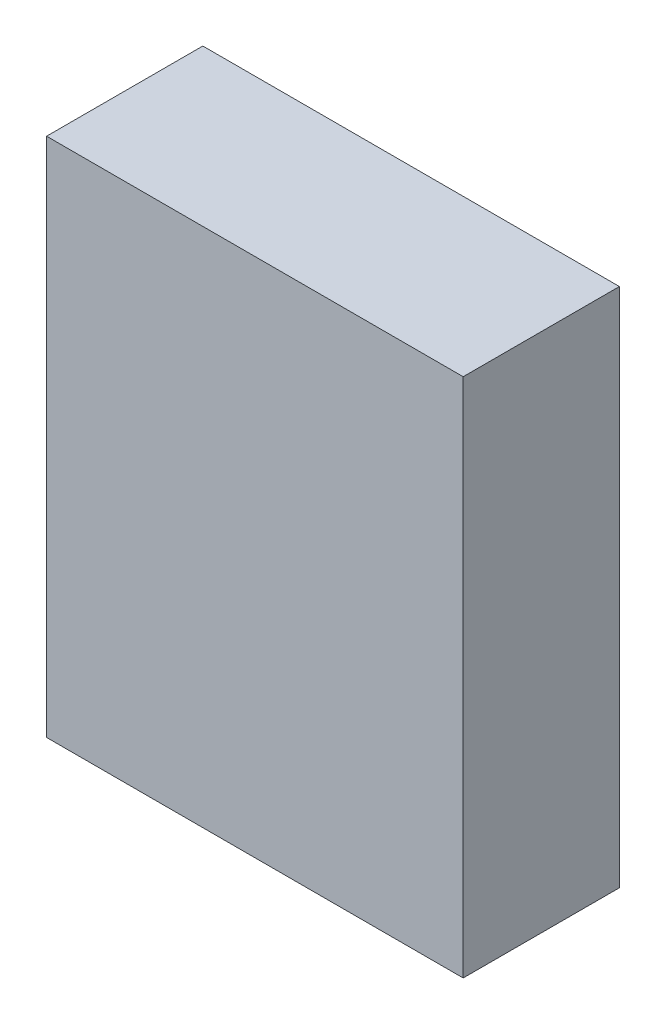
ISO-10303-21;
HEADER;
FILE_DESCRIPTION(('STEP AP214'),'2;1');
FILE_NAME('part.step','',(''),(''),'','','');
FILE_SCHEMA(('AUTOMOTIVE_DESIGN { 1 0 10303 214 1 1 1 1 }'));
ENDSEC;
DATA;
#1=APPLICATION_CONTEXT('core data for automotive mechanical design processes');
#2=APPLICATION_PROTOCOL_DEFINITION('international standard','automotive_design',2000,#1);
#3=PRODUCT_CONTEXT('',#1,'mechanical');
#4=PRODUCT('Part','Part','',(#3));
#5=PRODUCT_RELATED_PRODUCT_CATEGORY('part','',(#4));
#6=PRODUCT_DEFINITION_FORMATION('','',#4);
#7=PRODUCT_DEFINITION_CONTEXT('part definition',#1,'design');
#8=PRODUCT_DEFINITION('design','',#6,#7);
#9=PRODUCT_DEFINITION_SHAPE('','',#8);
#10=(LENGTH_UNIT() NAMED_UNIT(*) SI_UNIT(.MILLI.,.METRE.));
#11=(NAMED_UNIT(*) PLANE_ANGLE_UNIT() SI_UNIT($,.RADIAN.));
#12=(NAMED_UNIT(*) SI_UNIT($,.STERADIAN.) SOLID_ANGLE_UNIT());
#13=UNCERTAINTY_MEASURE_WITH_UNIT(LENGTH_MEASURE(1.E-05),#10,'distance_accuracy_value','');
#14=(GEOMETRIC_REPRESENTATION_CONTEXT(3) GLOBAL_UNCERTAINTY_ASSIGNED_CONTEXT((#13)) GLOBAL_UNIT_ASSIGNED_CONTEXT((#10,
#11,#12)) REPRESENTATION_CONTEXT('',''));
#15=CARTESIAN_POINT('',(0.,0.,0.));
#16=DIRECTION('',(0.,0.,1.));
#17=DIRECTION('',(1.,0.,0.));
#18=AXIS2_PLACEMENT_3D('',#15,#16,#17);
#19=CARTESIAN_POINT('',(-2.00000108,-2.50000008,1.49999954));
#20=DIRECTION('',(0.,0.,-1.));
#21=DIRECTION('',(-1.,0.,0.));
#22=AXIS2_PLACEMENT_3D('',#19,#20,#21);
#23=PLANE('',#22);
#24=DIRECTION('',(0.,1.,0.));
#25=VECTOR('',#24,1.);
#26=CARTESIAN_POINT('',(2.00000108,-2.50000008,1.49999954));
#27=LINE('',#26,#25);
#28=CARTESIAN_POINT('',(2.00000108,-2.50000008,1.49999954));
#29=VERTEX_POINT('',#28);
#30=CARTESIAN_POINT('',(2.00000108,2.50000008,1.49999954));
#31=VERTEX_POINT('',#30);
#32=EDGE_CURVE('E54',#29,#31,#27,.T.);
#33=ORIENTED_EDGE('',*,*,#32,.T.);
#34=DIRECTION('',(1.,0.,0.));
#35=VECTOR('',#34,1.);
#36=CARTESIAN_POINT('',(2.00000108,2.50000008,1.49999954));
#37=LINE('',#36,#35);
#38=CARTESIAN_POINT('',(-2.00000108,2.50000008,1.49999954));
#39=VERTEX_POINT('',#38);
#40=EDGE_CURVE('E56',#31,#39,#37,.F.);
#41=ORIENTED_EDGE('',*,*,#40,.T.);
#42=DIRECTION('',(0.,1.,0.));
#43=VECTOR('',#42,1.);
#44=CARTESIAN_POINT('',(-2.00000108,2.50000008,1.49999954));
#45=LINE('',#44,#43);
#46=CARTESIAN_POINT('',(-2.00000108,-2.50000008,1.49999954));
#47=VERTEX_POINT('',#46);
#48=EDGE_CURVE('E19',#39,#47,#45,.F.);
#49=ORIENTED_EDGE('',*,*,#48,.T.);
#50=DIRECTION('',(1.,0.,0.));
#51=VECTOR('',#50,1.);
#52=CARTESIAN_POINT('',(-2.00000108,-2.50000008,1.49999954));
#53=LINE('',#52,#51);
#54=EDGE_CURVE('E79',#47,#29,#53,.T.);
#55=ORIENTED_EDGE('',*,*,#54,.T.);
#56=EDGE_LOOP('',(#33,#41,#49,#55));
#57=FACE_BOUND('',#56,.T.);
#58=ADVANCED_FACE('F16',(#57),#23,.F.);
#59=CARTESIAN_POINT('',(-2.00000108,2.50000008,0.));
#60=DIRECTION('',(1.,0.,0.));
#61=DIRECTION('',(0.,0.,-1.));
#62=AXIS2_PLACEMENT_3D('',#59,#60,#61);
#63=PLANE('',#62);
#64=DIRECTION('',(0.,0.,1.));
#65=VECTOR('',#64,1.);
#66=CARTESIAN_POINT('',(-2.00000108,-2.50000008,0.));
#67=LINE('',#66,#65);
#68=CARTESIAN_POINT('',(-2.00000108,-2.50000008,0.));
#69=VERTEX_POINT('',#68);
#70=EDGE_CURVE('E67',#69,#47,#67,.T.);
#71=ORIENTED_EDGE('',*,*,#70,.T.);
#72=ORIENTED_EDGE('',*,*,#48,.F.);
#73=DIRECTION('',(0.,0.,-1.));
#74=VECTOR('',#73,1.);
#75=CARTESIAN_POINT('',(-2.00000108,2.50000008,0.));
#76=LINE('',#75,#74);
#77=CARTESIAN_POINT('',(-2.00000108,2.50000008,0.));
#78=VERTEX_POINT('',#77);
#79=EDGE_CURVE('E62',#39,#78,#76,.T.);
#80=ORIENTED_EDGE('',*,*,#79,.T.);
#81=DIRECTION('',(0.,1.,0.));
#82=VECTOR('',#81,1.);
#83=CARTESIAN_POINT('',(-2.00000108,-2.50000008,0.));
#84=LINE('',#83,#82);
#85=EDGE_CURVE('E82',#69,#78,#84,.T.);
#86=ORIENTED_EDGE('',*,*,#85,.F.);
#87=EDGE_LOOP('',(#71,#72,#80,#86));
#88=FACE_BOUND('',#87,.T.);
#89=ADVANCED_FACE('F64',(#88),#63,.F.);
#90=CARTESIAN_POINT('',(2.00000108,2.50000008,0.));
#91=DIRECTION('',(0.,-1.,0.));
#92=DIRECTION('',(0.,0.,-1.));
#93=AXIS2_PLACEMENT_3D('',#90,#91,#92);
#94=PLANE('',#93);
#95=ORIENTED_EDGE('',*,*,#79,.F.);
#96=ORIENTED_EDGE('',*,*,#40,.F.);
#97=DIRECTION('',(0.,0.,1.));
#98=VECTOR('',#97,1.);
#99=CARTESIAN_POINT('',(2.00000108,2.50000008,0.));
#100=LINE('',#99,#98);
#101=CARTESIAN_POINT('',(2.00000108,2.50000008,0.));
#102=VERTEX_POINT('',#101);
#103=EDGE_CURVE('E74',#31,#102,#100,.F.);
#104=ORIENTED_EDGE('',*,*,#103,.T.);
#105=DIRECTION('',(-1.,0.,0.));
#106=VECTOR('',#105,1.);
#107=CARTESIAN_POINT('',(-2.00000108,2.50000008,0.));
#108=LINE('',#107,#106);
#109=EDGE_CURVE('E71',#78,#102,#108,.F.);
#110=ORIENTED_EDGE('',*,*,#109,.F.);
#111=EDGE_LOOP('',(#95,#96,#104,#110));
#112=FACE_BOUND('',#111,.T.);
#113=ADVANCED_FACE('F69',(#112),#94,.F.);
#114=CARTESIAN_POINT('',(2.00000108,-2.50000008,0.));
#115=DIRECTION('',(-1.,0.,0.));
#116=DIRECTION('',(0.,0.,1.));
#117=AXIS2_PLACEMENT_3D('',#114,#115,#116);
#118=PLANE('',#117);
#119=ORIENTED_EDGE('',*,*,#103,.F.);
#120=ORIENTED_EDGE('',*,*,#32,.F.);
#121=DIRECTION('',(0.,0.,1.));
#122=VECTOR('',#121,1.);
#123=CARTESIAN_POINT('',(2.00000108,-2.50000008,0.));
#124=LINE('',#123,#122);
#125=CARTESIAN_POINT('',(2.00000108,-2.50000008,0.));
#126=VERTEX_POINT('',#125);
#127=EDGE_CURVE('E34',#29,#126,#124,.F.);
#128=ORIENTED_EDGE('',*,*,#127,.T.);
#129=DIRECTION('',(0.,1.,0.));
#130=VECTOR('',#129,1.);
#131=CARTESIAN_POINT('',(2.00000108,-2.50000008,0.));
#132=LINE('',#131,#130);
#133=EDGE_CURVE('E25',#102,#126,#132,.F.);
#134=ORIENTED_EDGE('',*,*,#133,.F.);
#135=EDGE_LOOP('',(#119,#120,#128,#134));
#136=FACE_BOUND('',#135,.T.);
#137=ADVANCED_FACE('F88',(#136),#118,.F.);
#138=CARTESIAN_POINT('',(-2.00000108,-2.50000008,0.));
#139=DIRECTION('',(0.,1.,0.));
#140=DIRECTION('',(0.,0.,1.));
#141=AXIS2_PLACEMENT_3D('',#138,#139,#140);
#142=PLANE('',#141);
#143=ORIENTED_EDGE('',*,*,#127,.F.);
#144=ORIENTED_EDGE('',*,*,#54,.F.);
#145=ORIENTED_EDGE('',*,*,#70,.F.);
#146=DIRECTION('',(-1.,0.,0.));
#147=VECTOR('',#146,1.);
#148=CARTESIAN_POINT('',(-2.00000108,-2.50000008,0.));
#149=LINE('',#148,#147);
#150=EDGE_CURVE('E11',#126,#69,#149,.T.);
#151=ORIENTED_EDGE('',*,*,#150,.F.);
#152=EDGE_LOOP('',(#143,#144,#145,#151));
#153=FACE_BOUND('',#152,.T.);
#154=ADVANCED_FACE('F90',(#153),#142,.F.);
#155=CARTESIAN_POINT('',(-2.00000108,-2.50000008,0.));
#156=DIRECTION('',(0.,0.,-1.));
#157=DIRECTION('',(-1.,0.,0.));
#158=AXIS2_PLACEMENT_3D('',#155,#156,#157);
#159=PLANE('',#158);
#160=ORIENTED_EDGE('',*,*,#133,.T.);
#161=ORIENTED_EDGE('',*,*,#150,.T.);
#162=ORIENTED_EDGE('',*,*,#85,.T.);
#163=ORIENTED_EDGE('',*,*,#109,.T.);
#164=EDGE_LOOP('',(#160,#161,#162,#163));
#165=FACE_BOUND('',#164,.T.);
#166=ADVANCED_FACE('F87',(#165),#159,.T.);
#167=CLOSED_SHELL('',(#58,#89,#113,#137,#154,#166));
#168=MANIFOLD_SOLID_BREP('B1',#167);
#169=ADVANCED_BREP_SHAPE_REPRESENTATION('',(#18,#168),#14);
#170=SHAPE_DEFINITION_REPRESENTATION(#9,#169);
ENDSEC;
END-ISO-10303-21;
